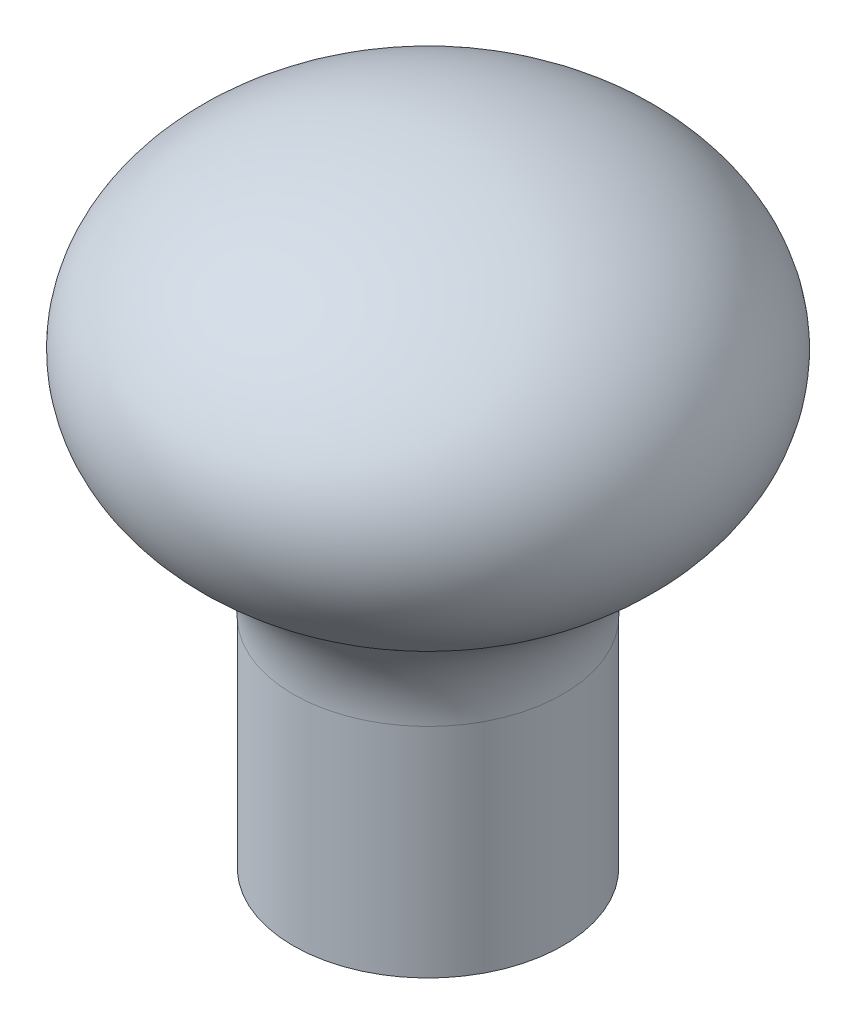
ISO-10303-21;
HEADER;
FILE_DESCRIPTION(('STEP AP214'),'2;1');
FILE_NAME('part.step','',(''),(''),'','','');
FILE_SCHEMA(('AUTOMOTIVE_DESIGN { 1 0 10303 214 1 1 1 1 }'));
ENDSEC;
DATA;
#1=APPLICATION_CONTEXT('core data for automotive mechanical design processes');
#2=APPLICATION_PROTOCOL_DEFINITION('international standard','automotive_design',2000,#1);
#3=PRODUCT_CONTEXT('',#1,'mechanical');
#4=PRODUCT('Part','Part','',(#3));
#5=PRODUCT_RELATED_PRODUCT_CATEGORY('part','',(#4));
#6=PRODUCT_DEFINITION_FORMATION('','',#4);
#7=PRODUCT_DEFINITION_CONTEXT('part definition',#1,'design');
#8=PRODUCT_DEFINITION('design','',#6,#7);
#9=PRODUCT_DEFINITION_SHAPE('','',#8);
#10=(LENGTH_UNIT() NAMED_UNIT(*) SI_UNIT(.MILLI.,.METRE.));
#11=(NAMED_UNIT(*) PLANE_ANGLE_UNIT() SI_UNIT($,.RADIAN.));
#12=(NAMED_UNIT(*) SI_UNIT($,.STERADIAN.) SOLID_ANGLE_UNIT());
#13=UNCERTAINTY_MEASURE_WITH_UNIT(LENGTH_MEASURE(1.E-05),#10,'distance_accuracy_value','');
#14=(GEOMETRIC_REPRESENTATION_CONTEXT(3) GLOBAL_UNCERTAINTY_ASSIGNED_CONTEXT((#13)) GLOBAL_UNIT_ASSIGNED_CONTEXT((#10,
#11,#12)) REPRESENTATION_CONTEXT('',''));
#15=CARTESIAN_POINT('',(0.,0.,0.));
#16=DIRECTION('',(0.,0.,1.));
#17=DIRECTION('',(1.,0.,0.));
#18=AXIS2_PLACEMENT_3D('',#15,#16,#17);
#19=CARTESIAN_POINT('',(0.,0.,0.));
#20=DIRECTION('',(0.,-1.,0.));
#21=DIRECTION('',(0.,0.,-1.));
#22=AXIS2_PLACEMENT_3D('',#19,#20,#21);
#23=PLANE('',#22);
#24=CARTESIAN_POINT('',(0.,0.,0.));
#25=DIRECTION('',(0.,-1.,0.));
#26=DIRECTION('',(0.,0.,-1.));
#27=AXIS2_PLACEMENT_3D('',#24,#25,#26);
#28=CIRCLE('',#27,7.50000000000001);
#29=CARTESIAN_POINT('',(0.,0.,-7.50000000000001));
#30=VERTEX_POINT('',#29);
#31=EDGE_CURVE('E69',#30,#30,#28,.T.);
#32=ORIENTED_EDGE('',*,*,#31,.T.);
#33=EDGE_LOOP('',(#32));
#34=FACE_BOUND('',#33,.T.);
#35=ADVANCED_FACE('F39',(#34),#23,.T.);
#36=CARTESIAN_POINT('',(0.,0.,0.));
#37=DIRECTION('',(0.,-1.,0.));
#38=DIRECTION('',(0.,0.,-1.));
#39=AXIS2_PLACEMENT_3D('',#36,#37,#38);
#40=CYLINDRICAL_SURFACE('',#39,7.5);
#41=CARTESIAN_POINT('',(0.,12.1115826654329,0.));
#42=DIRECTION('',(0.,-1.,0.));
#43=DIRECTION('',(0.,0.,-1.));
#44=AXIS2_PLACEMENT_3D('',#41,#42,#43);
#45=CIRCLE('',#44,7.5);
#46=CARTESIAN_POINT('',(0.,12.1115826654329,-7.5));
#47=VERTEX_POINT('',#46);
#48=EDGE_CURVE('E47',#47,#47,#45,.T.);
#49=ORIENTED_EDGE('',*,*,#48,.T.);
#50=EDGE_LOOP('',(#49));
#51=FACE_BOUND('',#50,.T.);
#52=ORIENTED_EDGE('',*,*,#31,.F.);
#53=EDGE_LOOP('',(#52));
#54=FACE_BOUND('',#53,.T.);
#55=ADVANCED_FACE('F52',(#51,#54),#40,.T.);
#56=CARTESIAN_POINT('',(0.,25.,0.));
#57=DIRECTION('',(0.,0.,1.));
#58=DIRECTION('',(1.,0.,0.));
#59=AXIS2_PLACEMENT_3D('',#56,#57,#58);
#60=ELLIPSE('',#59,15.,10.);
#61=TRIMMED_CURVE('',#60,(PARAMETER_VALUE(4.71238898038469)),
(PARAMETER_VALUE(7.85398163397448)),.T.,.PARAMETER.);
#62=CARTESIAN_POINT('',(0.,0.,0.));
#63=DIRECTION('',(0.,-1.,0.));
#64=AXIS1_PLACEMENT('',#62,#63);
#65=SURFACE_OF_REVOLUTION('',#61,#64);
#66=CARTESIAN_POINT('',(0.,17.9335786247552,0.));
#67=DIRECTION('',(0.,-1.,0.));
#68=DIRECTION('',(0.,0.,-1.));
#69=AXIS2_PLACEMENT_3D('',#66,#67,#68);
#70=CIRCLE('',#69,10.6135667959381);
#71=CARTESIAN_POINT('',(0.,17.9335786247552,-10.6135667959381));
#72=VERTEX_POINT('',#71);
#73=EDGE_CURVE('E11',#72,#72,#70,.F.);
#74=ORIENTED_EDGE('',*,*,#73,.T.);
#75=EDGE_LOOP('',(#74));
#76=FACE_BOUND('',#75,.T.);
#77=CARTESIAN_POINT('',(0.,35.,0.));
#78=VERTEX_POINT('',#77);
#79=VERTEX_LOOP('',#78);
#80=FACE_BOUND('',#79,.T.);
#81=ADVANCED_FACE('F50',(#76,#80),#65,.F.);
#82=CARTESIAN_POINT('',(0.,12.1115826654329,0.));
#83=DIRECTION('',(0.,-1.,0.));
#84=DIRECTION('',(0.,0.,-1.));
#85=AXIS2_PLACEMENT_3D('',#82,#83,#84);
#86=TOROIDAL_SURFACE('',#85,14.5,7.);
#87=ORIENTED_EDGE('',*,*,#73,.F.);
#88=EDGE_LOOP('',(#87));
#89=FACE_BOUND('',#88,.T.);
#90=ORIENTED_EDGE('',*,*,#48,.F.);
#91=EDGE_LOOP('',(#90));
#92=FACE_BOUND('',#91,.T.);
#93=ADVANCED_FACE('F41',(#89,#92),#86,.F.);
#94=CLOSED_SHELL('',(#35,#55,#81,#93));
#95=MANIFOLD_SOLID_BREP('B2',#94);
#96=ADVANCED_BREP_SHAPE_REPRESENTATION('',(#18,#95),#14);
#97=SHAPE_DEFINITION_REPRESENTATION(#9,#96);
ENDSEC;
END-ISO-10303-21;
